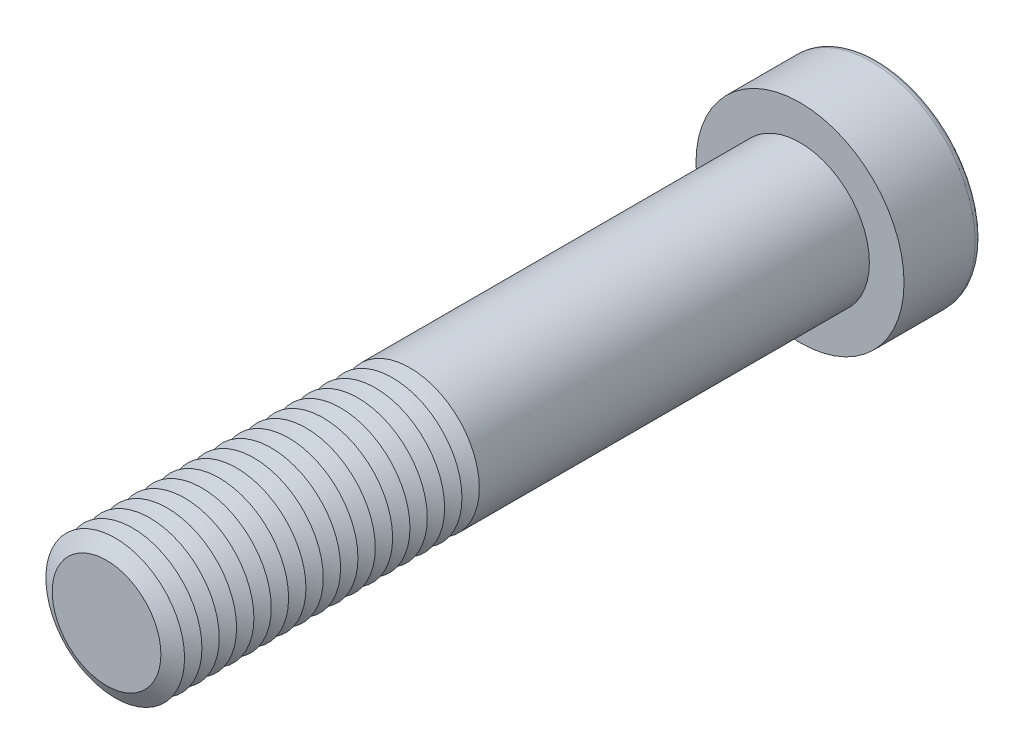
from build123d import *

# Parameters (mm, degrees)
SKETCH1_R           = 8
BOSS_EXTRUDE1_DEPTH = 80
SKETCH2_R           = 12
BOSS_EXTRUDE2_DEPTH = 9
CUT_EXTRUDE1_DEPTH  = 9
FILLET1_R           = 0.8
LPATTERN1_COUNT     = 18
LPATTERN1_PITCH     = 2


with BuildPart() as part:
    # Sketch1 → Boss-Extrude1 (new body)
    with BuildSketch(Plane.XY):
        Circle(SKETCH1_R)
    extrude(amount=BOSS_EXTRUDE1_DEPTH)

    # Sketch2 → Boss-Extrude2 (add)
    with BuildSketch(Plane(origin=(0, 0, 0), x_dir=(-1, 0, 0), z_dir=(0, 0, -1))):
        Circle(SKETCH2_R)
    extrude(amount=BOSS_EXTRUDE2_DEPTH)

    # Sketch3 → Cut-Extrude1 (cut)
    with BuildSketch(Plane(origin=(0, 0, -9), x_dir=(-1, 0, 0), z_dir=(0, 0, -1))):
        Polygon((-3.464101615, 6), (-6.92820323, 0), (-3.464101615, -6), (3.464101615, -6), (6.92820323, 0), (3.464101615, 6), align=None)
    extrude(amount=-CUT_EXTRUDE1_DEPTH, mode=Mode.SUBTRACT)

    # Fillet1
    fillet1_edges = [part.edges().sort_by_distance(p)[0] for p in [
        (12, 0, -9),
    ]]
    fillet(fillet1_edges, radius=FILLET1_R)

    # Cut-Extrude2 cone 1 section (on through the dimple's axis) → Cut-Extrude2 (revolve, cut)
    with BuildSketch(Plane.YZ):
        Polygon((0, 0), (6, 0), (0, 3.464101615), align=None)
    revolve(axis=Axis((0, 0, 0), (0, 0, 1)), mode=Mode.SUBTRACT)

    # Cut-Extrude3 cone 1 section (on through the dimple's axis) → Cut-Extrude3 (revolve, cut)
    with BuildSketch(Plane(origin=(0, 0, -9), x_dir=(0, 1, 0), z_dir=(1, 0, 0))):
        Polygon((0, 0), (6.92820323, 0), (0, 1.856406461), align=None)
    revolve(axis=Axis((0, 0, -9), (0, 0, 1)), mode=Mode.SUBTRACT)

    # Sketch7 → Cut-Revolve1 (revolve, cut)
    with BuildSketch(Plane(origin=(0, 0, 0), x_dir=(0, 0, -1), z_dir=(1, 0, 0)), mode=Mode.PRIVATE) as cut_revolve1_sk:
        Polygon((-80, 6.267949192), (-79, 8), (-81, 8), align=None)
    cut_revolve1 = revolve(cut_revolve1_sk.sketch.rotate(Axis((0, 0, 80), (0, 0, -1)), 90), axis=Axis((0, 0, 80), (0, 0, -1)), mode=Mode.SUBTRACT)

    # LPattern1: Cut-Revolve1 ×18
    with Locations(*[(0, 0, -i * LPATTERN1_PITCH) for i in range(1, LPATTERN1_COUNT)]):
        add(cut_revolve1, mode=Mode.SUBTRACT)


solid = part.part
